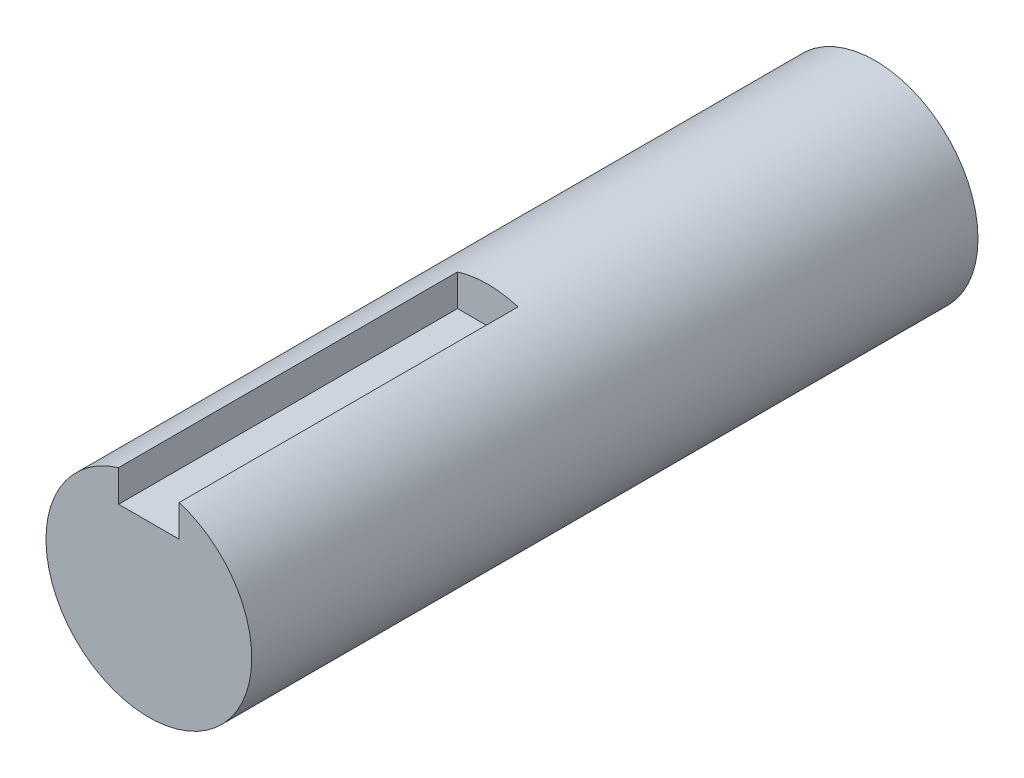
from build123d import *

# Parameters (mm, degrees)
ESQUISSE1_R                  = 8.5
BASE_EXTRUSION_DEPTH         = 60
ENL_V_MAT_EXTRU_1_DEPTH      = 2.5
ENL_V_MAT_EXTRU_1_DEPTH_BACK = 2.5
ESQUISSE2_W                  = 28
ESQUISSE2_H                  = 5


with BuildPart() as part:
    # Esquisse1 → Base-Extrusion (new body)
    with BuildSketch(Plane.XY):
        Circle(ESQUISSE1_R)
    extrude(amount=-BASE_EXTRUSION_DEPTH)

    # Esquisse2 → Enl_v. mat.-Extru.1 (cut, two sides: drawn at the far end of the back side and taken through both)
    with BuildSketch(Plane(origin=(0, 0, 0), x_dir=(0, 0, -1), z_dir=(1, 0, 0)).offset(-ENL_V_MAT_EXTRU_1_DEPTH_BACK)):
        with Locations((14, 8)):
            Rectangle(ESQUISSE2_W, ESQUISSE2_H)
    extrude(amount=ENL_V_MAT_EXTRU_1_DEPTH + ENL_V_MAT_EXTRU_1_DEPTH_BACK, mode=Mode.SUBTRACT)


solid = part.part
